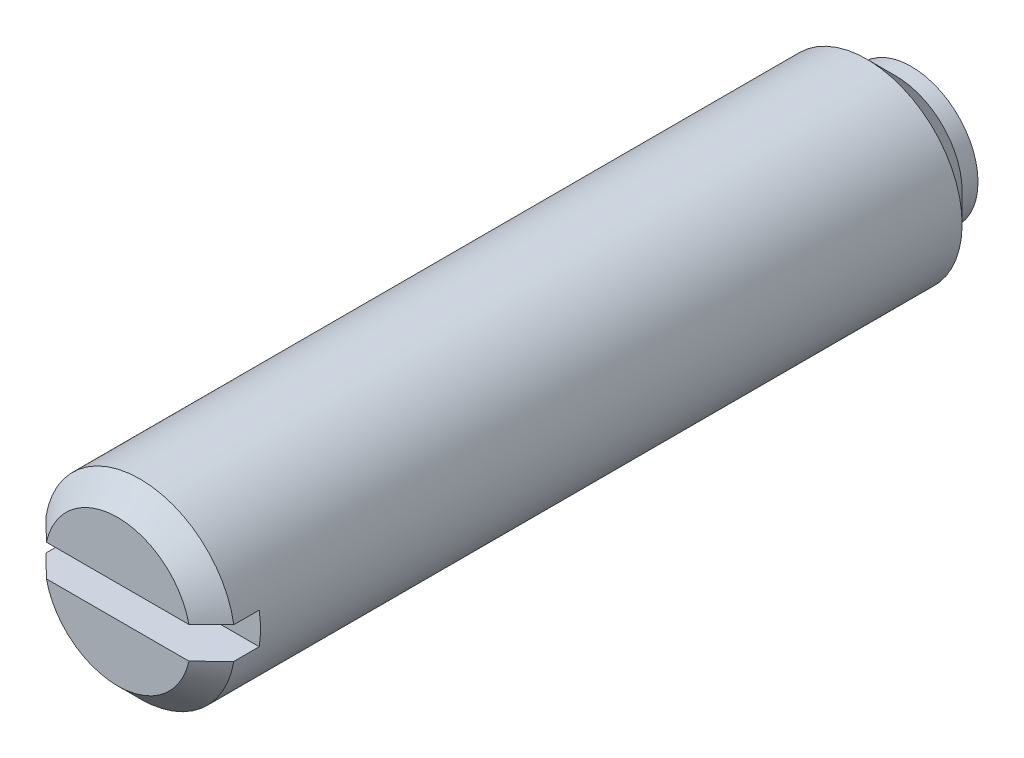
ISO-10303-21;
HEADER;
FILE_DESCRIPTION(('STEP AP214'),'2;1');
FILE_NAME('part.step','',(''),(''),'','','');
FILE_SCHEMA(('AUTOMOTIVE_DESIGN { 1 0 10303 214 1 1 1 1 }'));
ENDSEC;
DATA;
#1=APPLICATION_CONTEXT('core data for automotive mechanical design processes');
#2=APPLICATION_PROTOCOL_DEFINITION('international standard','automotive_design',2000,#1);
#3=PRODUCT_CONTEXT('',#1,'mechanical');
#4=PRODUCT('Part','Part','',(#3));
#5=PRODUCT_RELATED_PRODUCT_CATEGORY('part','',(#4));
#6=PRODUCT_DEFINITION_FORMATION('','',#4);
#7=PRODUCT_DEFINITION_CONTEXT('part definition',#1,'design');
#8=PRODUCT_DEFINITION('design','',#6,#7);
#9=PRODUCT_DEFINITION_SHAPE('','',#8);
#10=(LENGTH_UNIT() NAMED_UNIT(*) SI_UNIT(.MILLI.,.METRE.));
#11=(NAMED_UNIT(*) PLANE_ANGLE_UNIT() SI_UNIT($,.RADIAN.));
#12=(NAMED_UNIT(*) SI_UNIT($,.STERADIAN.) SOLID_ANGLE_UNIT());
#13=UNCERTAINTY_MEASURE_WITH_UNIT(LENGTH_MEASURE(1.E-05),#10,'distance_accuracy_value','');
#14=(GEOMETRIC_REPRESENTATION_CONTEXT(3) GLOBAL_UNCERTAINTY_ASSIGNED_CONTEXT((#13)) GLOBAL_UNIT_ASSIGNED_CONTEXT((#10,
#11,#12)) REPRESENTATION_CONTEXT('',''));
#15=CARTESIAN_POINT('',(0.,0.,0.));
#16=DIRECTION('',(0.,0.,1.));
#17=DIRECTION('',(1.,0.,0.));
#18=AXIS2_PLACEMENT_3D('',#15,#16,#17);
#19=CARTESIAN_POINT('',(0.,0.,1.));
#20=DIRECTION('',(0.,0.,-1.));
#21=DIRECTION('',(-1.,0.,0.));
#22=AXIS2_PLACEMENT_3D('',#19,#20,#21);
#23=PLANE('',#22);
#24=CARTESIAN_POINT('',(0.,0.,1.));
#25=DIRECTION('',(0.,0.,-1.));
#26=DIRECTION('',(-1.,0.,0.));
#27=AXIS2_PLACEMENT_3D('',#24,#25,#26);
#28=CIRCLE('',#27,1.58113883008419);
#29=CARTESIAN_POINT('',(-1.58113883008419,0.,1.));
#30=VERTEX_POINT('',#29);
#31=EDGE_CURVE('E151',#30,#30,#28,.T.);
#32=ORIENTED_EDGE('',*,*,#31,.F.);
#33=EDGE_LOOP('',(#32));
#34=FACE_BOUND('',#33,.T.);
#35=CARTESIAN_POINT('',(0.,0.,1.));
#36=DIRECTION('',(0.,0.,1.));
#37=DIRECTION('',(1.,0.,0.));
#38=AXIS2_PLACEMENT_3D('',#35,#36,#37);
#39=CIRCLE('',#38,2.1);
#40=CARTESIAN_POINT('',(2.1,0.,1.));
#41=VERTEX_POINT('',#40);
#42=EDGE_CURVE('E158',#41,#41,#39,.T.);
#43=ORIENTED_EDGE('',*,*,#42,.F.);
#44=EDGE_LOOP('',(#43));
#45=FACE_BOUND('',#44,.T.);
#46=ADVANCED_FACE('F14',(#34,#45),#23,.T.);
#47=CARTESIAN_POINT('',(0.,0.,1.75));
#48=DIRECTION('',(0.,0.,-1.));
#49=DIRECTION('',(1.,0.,0.));
#50=AXIS2_PLACEMENT_3D('',#47,#48,#49);
#51=SPHERICAL_SURFACE('',#50,1.75);
#52=ORIENTED_EDGE('',*,*,#31,.T.);
#53=EDGE_LOOP('',(#52));
#54=FACE_BOUND('',#53,.T.);
#55=ADVANCED_FACE('F178',(#54),#51,.T.);
#56=CARTESIAN_POINT('',(0.,0.,28.9030924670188));
#57=DIRECTION('',(0.,0.,1.));
#58=DIRECTION('',(1.,0.,0.));
#59=AXIS2_PLACEMENT_3D('',#56,#57,#58);
#60=CYLINDRICAL_SURFACE('',#59,2.1);
#61=ORIENTED_EDGE('',*,*,#42,.T.);
#62=EDGE_LOOP('',(#61));
#63=FACE_BOUND('',#62,.T.);
#64=CARTESIAN_POINT('',(0.,0.,1.5));
#65=DIRECTION('',(0.,0.,1.));
#66=DIRECTION('',(1.,0.,0.));
#67=AXIS2_PLACEMENT_3D('',#64,#65,#66);
#68=CIRCLE('',#67,2.1);
#69=CARTESIAN_POINT('',(2.1,0.,1.5));
#70=VERTEX_POINT('',#69);
#71=EDGE_CURVE('E161',#70,#70,#68,.T.);
#72=ORIENTED_EDGE('',*,*,#71,.F.);
#73=EDGE_LOOP('',(#72));
#74=FACE_BOUND('',#73,.T.);
#75=ADVANCED_FACE('F170',(#63,#74),#60,.T.);
#76=CARTESIAN_POINT('',(0.,0.,2.4));
#77=DIRECTION('',(0.,0.,1.));
#78=DIRECTION('',(1.,0.,0.));
#79=AXIS2_PLACEMENT_3D('',#76,#77,#78);
#80=CONICAL_SURFACE('',#79,3.,0.785398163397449);
#81=ORIENTED_EDGE('',*,*,#71,.T.);
#82=EDGE_LOOP('',(#81));
#83=FACE_BOUND('',#82,.T.);
#84=CARTESIAN_POINT('',(0.,0.,2.4));
#85=DIRECTION('',(0.,0.,1.));
#86=DIRECTION('',(1.,0.,0.));
#87=AXIS2_PLACEMENT_3D('',#84,#85,#86);
#88=CIRCLE('',#87,3.);
#89=CARTESIAN_POINT('',(3.,0.,2.4));
#90=VERTEX_POINT('',#89);
#91=EDGE_CURVE('E164',#90,#90,#88,.T.);
#92=ORIENTED_EDGE('',*,*,#91,.F.);
#93=EDGE_LOOP('',(#92));
#94=FACE_BOUND('',#93,.T.);
#95=ADVANCED_FACE('F168',(#83,#94),#80,.T.);
#96=CARTESIAN_POINT('',(0.,3.,26.));
#97=DIRECTION('',(0.,0.,1.));
#98=DIRECTION('',(1.,0.,0.));
#99=AXIS2_PLACEMENT_3D('',#96,#97,#98);
#100=PLANE('',#99);
#101=DIRECTION('',(1.,0.,0.));
#102=VECTOR('',#101,1.);
#103=CARTESIAN_POINT('',(-2.95803989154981,-0.5,26.));
#104=LINE('',#103,#102);
#105=CARTESIAN_POINT('',(-2.24499443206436,-0.5,26.));
#106=VERTEX_POINT('',#105);
#107=CARTESIAN_POINT('',(2.24499443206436,-0.5,26.));
#108=VERTEX_POINT('',#107);
#109=EDGE_CURVE('E148',#106,#108,#104,.T.);
#110=ORIENTED_EDGE('',*,*,#109,.F.);
#111=CARTESIAN_POINT('',(0.,0.,26.));
#112=DIRECTION('',(0.,0.,1.));
#113=DIRECTION('',(1.,0.,0.));
#114=AXIS2_PLACEMENT_3D('',#111,#112,#113);
#115=CIRCLE('',#114,2.3);
#116=EDGE_CURVE('E142',#106,#108,#115,.T.);
#117=ORIENTED_EDGE('',*,*,#116,.T.);
#118=EDGE_LOOP('',(#110,#117));
#119=FACE_BOUND('',#118,.T.);
#120=ADVANCED_FACE('F124',(#119),#100,.T.);
#121=CARTESIAN_POINT('',(-2.95803989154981,-0.5,24.5));
#122=DIRECTION('',(0.,-1.,0.));
#123=DIRECTION('',(1.,0.,0.));
#124=AXIS2_PLACEMENT_3D('',#121,#122,#123);
#125=PLANE('',#124);
#126=DIRECTION('',(0.,0.,1.));
#127=VECTOR('',#126,1.);
#128=CARTESIAN_POINT('',(-2.95803989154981,-0.5,24.5));
#129=LINE('',#128,#127);
#130=CARTESIAN_POINT('',(-2.95803989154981,-0.5,24.5));
#131=VERTEX_POINT('',#130);
#132=CARTESIAN_POINT('',(-2.95803989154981,-0.5,25.3));
#133=VERTEX_POINT('',#132);
#134=EDGE_CURVE('E81',#131,#133,#129,.T.);
#135=ORIENTED_EDGE('',*,*,#134,.T.);
#136=CARTESIAN_POINT('',(-2.95803989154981,-0.5,25.3));
#137=CARTESIAN_POINT('',(-2.89874678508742,-0.5,25.3584629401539));
#138=CARTESIAN_POINT('',(-2.8394301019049,-0.5,25.4169019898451));
#139=CARTESIAN_POINT('',(-2.72073800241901,-0.5,25.5337202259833));
#140=CARTESIAN_POINT('',(-2.66136258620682,-0.5,25.5920994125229));
#141=CARTESIAN_POINT('',(-2.54254122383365,-0.5,25.7087860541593));
#142=CARTESIAN_POINT('',(-2.48309527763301,-0.5,25.7670935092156));
#143=CARTESIAN_POINT('',(-2.36411528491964,-0.5,25.8836186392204));
#144=CARTESIAN_POINT('',(-2.30458123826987,-0.5,25.9418363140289));
#145=CARTESIAN_POINT('',(-2.24499443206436,-0.5,26.));
#146=B_SPLINE_CURVE_WITH_KNOTS('',3,(#136,#137,#138,#139,#140,#141,#142,#143,#144,#145),
.UNSPECIFIED.,.F.,.F.,(4,2,2,2,4),(0.,0.249804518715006,0.499608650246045,0.74941292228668,
0.999217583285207),.UNSPECIFIED.);
#147=EDGE_CURVE('E110',#133,#106,#146,.T.);
#148=ORIENTED_EDGE('',*,*,#147,.T.);
#149=ORIENTED_EDGE('',*,*,#109,.T.);
#150=CARTESIAN_POINT('',(2.24499443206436,-0.5,26.));
#151=CARTESIAN_POINT('',(2.30458123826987,-0.5,25.9418363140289));
#152=CARTESIAN_POINT('',(2.36411528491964,-0.5,25.8836186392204));
#153=CARTESIAN_POINT('',(2.48309527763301,-0.5,25.7670935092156));
#154=CARTESIAN_POINT('',(2.54254122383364,-0.5,25.7087860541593));
#155=CARTESIAN_POINT('',(2.66136258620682,-0.5,25.5920994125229));
#156=CARTESIAN_POINT('',(2.72073800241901,-0.5,25.5337202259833));
#157=CARTESIAN_POINT('',(2.8394301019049,-0.5,25.4169019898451));
#158=CARTESIAN_POINT('',(2.89874678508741,-0.5,25.3584629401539));
#159=CARTESIAN_POINT('',(2.9580398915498,-0.5,25.3));
#160=B_SPLINE_CURVE_WITH_KNOTS('',3,(#150,#151,#152,#153,#154,#155,#156,#157,#158,#159),
.UNSPECIFIED.,.F.,.F.,(4,2,2,2,4),(0.,0.249804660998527,0.499608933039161,0.749413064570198,
0.999217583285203),.UNSPECIFIED.);
#161=CARTESIAN_POINT('',(2.95803989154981,-0.5,25.3));
#162=VERTEX_POINT('',#161);
#163=EDGE_CURVE('E103',#108,#162,#160,.T.);
#164=ORIENTED_EDGE('',*,*,#163,.T.);
#165=DIRECTION('',(0.,0.,1.));
#166=VECTOR('',#165,1.);
#167=CARTESIAN_POINT('',(2.95803989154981,-0.5,24.5));
#168=LINE('',#167,#166);
#169=CARTESIAN_POINT('',(2.95803989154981,-0.5,24.5));
#170=VERTEX_POINT('',#169);
#171=EDGE_CURVE('E83',#170,#162,#168,.T.);
#172=ORIENTED_EDGE('',*,*,#171,.F.);
#173=DIRECTION('',(1.,0.,0.));
#174=VECTOR('',#173,1.);
#175=CARTESIAN_POINT('',(-2.95803989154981,-0.5,24.5));
#176=LINE('',#175,#174);
#177=EDGE_CURVE('E68',#131,#170,#176,.T.);
#178=ORIENTED_EDGE('',*,*,#177,.F.);
#179=EDGE_LOOP('',(#135,#148,#149,#164,#172,#178));
#180=FACE_BOUND('',#179,.T.);
#181=ADVANCED_FACE('F80',(#180),#125,.F.);
#182=DIRECTION('',(1.,0.,0.));
#183=VECTOR('',#182,1.);
#184=CARTESIAN_POINT('',(-2.95803989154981,0.5,26.));
#185=LINE('',#184,#183);
#186=CARTESIAN_POINT('',(-2.24499443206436,0.5,26.));
#187=VERTEX_POINT('',#186);
#188=CARTESIAN_POINT('',(2.24499443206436,0.5,26.));
#189=VERTEX_POINT('',#188);
#190=EDGE_CURVE('E75',#187,#189,#185,.T.);
#191=ORIENTED_EDGE('',*,*,#190,.T.);
#192=CARTESIAN_POINT('',(0.,0.,26.));
#193=DIRECTION('',(0.,0.,1.));
#194=DIRECTION('',(1.,0.,0.));
#195=AXIS2_PLACEMENT_3D('',#192,#193,#194);
#196=CIRCLE('',#195,2.3);
#197=EDGE_CURVE('E9',#189,#187,#196,.T.);
#198=ORIENTED_EDGE('',*,*,#197,.T.);
#199=EDGE_LOOP('',(#191,#198));
#200=FACE_BOUND('',#199,.T.);
#201=ADVANCED_FACE('F123',(#200),#100,.T.);
#202=CARTESIAN_POINT('',(-2.95803989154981,0.5,24.5));
#203=DIRECTION('',(0.,-1.,0.));
#204=DIRECTION('',(1.,0.,0.));
#205=AXIS2_PLACEMENT_3D('',#202,#203,#204);
#206=PLANE('',#205);
#207=DIRECTION('',(0.,0.,1.));
#208=VECTOR('',#207,1.);
#209=CARTESIAN_POINT('',(2.95803989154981,0.5,24.5));
#210=LINE('',#209,#208);
#211=CARTESIAN_POINT('',(2.95803989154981,0.5,24.5));
#212=VERTEX_POINT('',#211);
#213=CARTESIAN_POINT('',(2.95803989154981,0.5,25.3));
#214=VERTEX_POINT('',#213);
#215=EDGE_CURVE('E92',#212,#214,#210,.T.);
#216=ORIENTED_EDGE('',*,*,#215,.T.);
#217=CARTESIAN_POINT('',(2.95803989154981,0.5,25.3));
#218=CARTESIAN_POINT('',(2.89874678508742,0.5,25.3584629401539));
#219=CARTESIAN_POINT('',(2.8394301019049,0.5,25.4169019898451));
#220=CARTESIAN_POINT('',(2.72073800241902,0.5,25.5337202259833));
#221=CARTESIAN_POINT('',(2.66136258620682,0.5,25.5920994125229));
#222=CARTESIAN_POINT('',(2.54254122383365,0.5,25.7087860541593));
#223=CARTESIAN_POINT('',(2.48309527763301,0.5,25.7670935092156));
#224=CARTESIAN_POINT('',(2.36411528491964,0.5,25.8836186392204));
#225=CARTESIAN_POINT('',(2.30458123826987,0.5,25.9418363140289));
#226=CARTESIAN_POINT('',(2.24499443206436,0.5,26.));
#227=B_SPLINE_CURVE_WITH_KNOTS('',3,(#217,#218,#219,#220,#221,#222,#223,#224,#225,#226),
.UNSPECIFIED.,.F.,.F.,(4,2,2,2,4),(0.,0.249804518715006,0.499608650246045,0.74941292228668,
0.999217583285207),.UNSPECIFIED.);
#228=EDGE_CURVE('E23',#214,#189,#227,.T.);
#229=ORIENTED_EDGE('',*,*,#228,.T.);
#230=ORIENTED_EDGE('',*,*,#190,.F.);
#231=CARTESIAN_POINT('',(-2.24499443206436,0.5,26.));
#232=CARTESIAN_POINT('',(-2.30458123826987,0.5,25.9418363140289));
#233=CARTESIAN_POINT('',(-2.36411528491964,0.5,25.8836186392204));
#234=CARTESIAN_POINT('',(-2.48309527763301,0.5,25.7670935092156));
#235=CARTESIAN_POINT('',(-2.54254122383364,0.5,25.7087860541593));
#236=CARTESIAN_POINT('',(-2.66136258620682,0.5,25.5920994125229));
#237=CARTESIAN_POINT('',(-2.72073800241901,0.5,25.5337202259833));
#238=CARTESIAN_POINT('',(-2.8394301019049,0.5,25.4169019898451));
#239=CARTESIAN_POINT('',(-2.89874678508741,0.5,25.3584629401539));
#240=CARTESIAN_POINT('',(-2.9580398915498,0.5,25.3));
#241=B_SPLINE_CURVE_WITH_KNOTS('',3,(#231,#232,#233,#234,#235,#236,#237,#238,#239,#240),
.UNSPECIFIED.,.F.,.F.,(4,2,2,2,4),(0.,0.249804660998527,0.499608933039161,0.749413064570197,
0.999217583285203),.UNSPECIFIED.);
#242=CARTESIAN_POINT('',(-2.95803989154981,0.5,25.3));
#243=VERTEX_POINT('',#242);
#244=EDGE_CURVE('E133',#187,#243,#241,.T.);
#245=ORIENTED_EDGE('',*,*,#244,.T.);
#246=DIRECTION('',(0.,0.,1.));
#247=VECTOR('',#246,1.);
#248=CARTESIAN_POINT('',(-2.95803989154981,0.5,24.5));
#249=LINE('',#248,#247);
#250=CARTESIAN_POINT('',(-2.95803989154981,0.5,24.5));
#251=VERTEX_POINT('',#250);
#252=EDGE_CURVE('E97',#251,#243,#249,.T.);
#253=ORIENTED_EDGE('',*,*,#252,.F.);
#254=DIRECTION('',(1.,0.,0.));
#255=VECTOR('',#254,1.);
#256=CARTESIAN_POINT('',(-2.95803989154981,0.5,24.5));
#257=LINE('',#256,#255);
#258=EDGE_CURVE('E71',#251,#212,#257,.T.);
#259=ORIENTED_EDGE('',*,*,#258,.T.);
#260=EDGE_LOOP('',(#216,#229,#230,#245,#253,#259));
#261=FACE_BOUND('',#260,.T.);
#262=ADVANCED_FACE('F126',(#261),#206,.T.);
#263=CARTESIAN_POINT('',(0.,0.,24.5));
#264=DIRECTION('',(0.,0.,1.));
#265=DIRECTION('',(1.,0.,0.));
#266=AXIS2_PLACEMENT_3D('',#263,#264,#265);
#267=PLANE('',#266);
#268=CARTESIAN_POINT('',(0.,0.,24.5));
#269=DIRECTION('',(0.,0.,1.));
#270=DIRECTION('',(1.,0.,0.));
#271=AXIS2_PLACEMENT_3D('',#268,#269,#270);
#272=CIRCLE('',#271,3.);
#273=EDGE_CURVE('E65',#251,#131,#272,.T.);
#274=ORIENTED_EDGE('',*,*,#273,.T.);
#275=ORIENTED_EDGE('',*,*,#177,.T.);
#276=EDGE_CURVE('E77',#170,#212,#272,.T.);
#277=ORIENTED_EDGE('',*,*,#276,.T.);
#278=ORIENTED_EDGE('',*,*,#258,.F.);
#279=EDGE_LOOP('',(#274,#275,#277,#278));
#280=FACE_BOUND('',#279,.T.);
#281=ADVANCED_FACE('F67',(#280),#267,.T.);
#282=CARTESIAN_POINT('',(0.,0.,6.));
#283=DIRECTION('',(0.,0.,-1.));
#284=DIRECTION('',(-1.,0.,0.));
#285=AXIS2_PLACEMENT_3D('',#282,#283,#284);
#286=CYLINDRICAL_SURFACE('',#285,3.);
#287=ORIENTED_EDGE('',*,*,#171,.T.);
#288=CARTESIAN_POINT('',(0.,0.,25.3));
#289=DIRECTION('',(0.,0.,1.));
#290=DIRECTION('',(1.,0.,0.));
#291=AXIS2_PLACEMENT_3D('',#288,#289,#290);
#292=CIRCLE('',#291,3.);
#293=EDGE_CURVE('E90',#162,#133,#292,.F.);
#294=ORIENTED_EDGE('',*,*,#293,.T.);
#295=ORIENTED_EDGE('',*,*,#134,.F.);
#296=ORIENTED_EDGE('',*,*,#273,.F.);
#297=ORIENTED_EDGE('',*,*,#252,.T.);
#298=CARTESIAN_POINT('',(0.,0.,25.3));
#299=DIRECTION('',(0.,0.,1.));
#300=DIRECTION('',(1.,0.,0.));
#301=AXIS2_PLACEMENT_3D('',#298,#299,#300);
#302=CIRCLE('',#301,3.);
#303=EDGE_CURVE('E99',#243,#214,#302,.F.);
#304=ORIENTED_EDGE('',*,*,#303,.T.);
#305=ORIENTED_EDGE('',*,*,#215,.F.);
#306=ORIENTED_EDGE('',*,*,#276,.F.);
#307=EDGE_LOOP('',(#287,#294,#295,#296,#297,#304,#305,#306));
#308=FACE_BOUND('',#307,.T.);
#309=ORIENTED_EDGE('',*,*,#91,.T.);
#310=EDGE_LOOP('',(#309));
#311=FACE_BOUND('',#310,.T.);
#312=ADVANCED_FACE('F87',(#308,#311),#286,.T.);
#313=CARTESIAN_POINT('',(0.,0.,25.3));
#314=DIRECTION('',(0.,0.,-1.));
#315=DIRECTION('',(-1.,0.,0.));
#316=AXIS2_PLACEMENT_3D('',#313,#314,#315);
#317=CONICAL_SURFACE('',#316,3.,0.785398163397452);
#318=ORIENTED_EDGE('',*,*,#163,.F.);
#319=ORIENTED_EDGE('',*,*,#116,.F.);
#320=ORIENTED_EDGE('',*,*,#147,.F.);
#321=ORIENTED_EDGE('',*,*,#293,.F.);
#322=EDGE_LOOP('',(#318,#319,#320,#321));
#323=FACE_BOUND('',#322,.T.);
#324=ADVANCED_FACE('F116',(#323),#317,.T.);
#325=CARTESIAN_POINT('',(0.,0.,25.3));
#326=DIRECTION('',(0.,0.,-1.));
#327=DIRECTION('',(-1.,0.,0.));
#328=AXIS2_PLACEMENT_3D('',#325,#326,#327);
#329=CONICAL_SURFACE('',#328,3.,0.785398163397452);
#330=ORIENTED_EDGE('',*,*,#244,.F.);
#331=ORIENTED_EDGE('',*,*,#197,.F.);
#332=ORIENTED_EDGE('',*,*,#228,.F.);
#333=ORIENTED_EDGE('',*,*,#303,.F.);
#334=EDGE_LOOP('',(#330,#331,#332,#333));
#335=FACE_BOUND('',#334,.T.);
#336=ADVANCED_FACE('F16',(#335),#329,.T.);
#337=CLOSED_SHELL('',(#46,#55,#75,#95,#120,#181,#201,#262,#281,#312,#324,#336));
#338=MANIFOLD_SOLID_BREP('B1',#337);
#339=ADVANCED_BREP_SHAPE_REPRESENTATION('',(#18,#338),#14);
#340=SHAPE_DEFINITION_REPRESENTATION(#9,#339);
ENDSEC;
END-ISO-10303-21;
